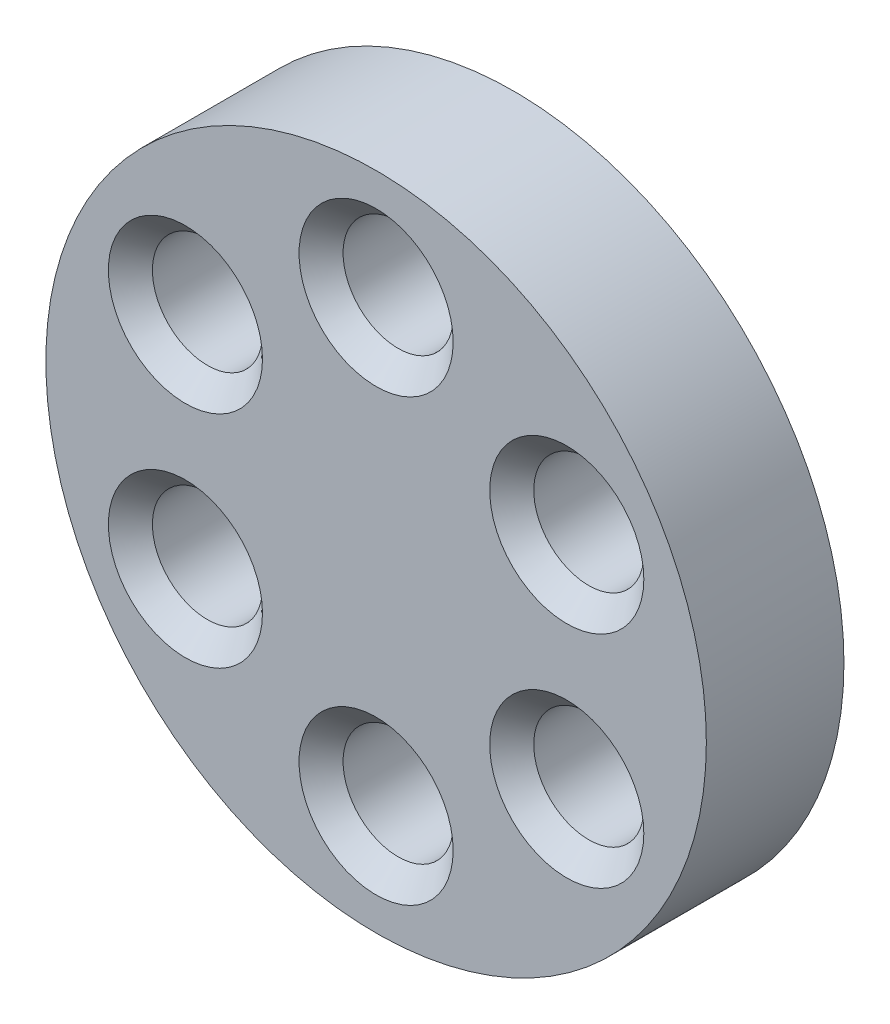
ISO-10303-21;
HEADER;
FILE_DESCRIPTION(('STEP AP214'),'2;1');
FILE_NAME('part.step','',(''),(''),'','','');
FILE_SCHEMA(('AUTOMOTIVE_DESIGN { 1 0 10303 214 1 1 1 1 }'));
ENDSEC;
DATA;
#1=APPLICATION_CONTEXT('core data for automotive mechanical design processes');
#2=APPLICATION_PROTOCOL_DEFINITION('international standard','automotive_design',2000,#1);
#3=PRODUCT_CONTEXT('',#1,'mechanical');
#4=PRODUCT('Part','Part','',(#3));
#5=PRODUCT_RELATED_PRODUCT_CATEGORY('part','',(#4));
#6=PRODUCT_DEFINITION_FORMATION('','',#4);
#7=PRODUCT_DEFINITION_CONTEXT('part definition',#1,'design');
#8=PRODUCT_DEFINITION('design','',#6,#7);
#9=PRODUCT_DEFINITION_SHAPE('','',#8);
#10=(LENGTH_UNIT() NAMED_UNIT(*) SI_UNIT(.MILLI.,.METRE.));
#11=(NAMED_UNIT(*) PLANE_ANGLE_UNIT() SI_UNIT($,.RADIAN.));
#12=(NAMED_UNIT(*) SI_UNIT($,.STERADIAN.) SOLID_ANGLE_UNIT());
#13=UNCERTAINTY_MEASURE_WITH_UNIT(LENGTH_MEASURE(1.E-05),#10,'distance_accuracy_value','');
#14=(GEOMETRIC_REPRESENTATION_CONTEXT(3) GLOBAL_UNCERTAINTY_ASSIGNED_CONTEXT((#13)) GLOBAL_UNIT_ASSIGNED_CONTEXT((#10,
#11,#12)) REPRESENTATION_CONTEXT('',''));
#15=CARTESIAN_POINT('',(0.,0.,0.));
#16=DIRECTION('',(0.,0.,1.));
#17=DIRECTION('',(1.,0.,0.));
#18=AXIS2_PLACEMENT_3D('',#15,#16,#17);
#19=CARTESIAN_POINT('',(0.,0.,25.));
#20=DIRECTION('',(0.,0.,-1.));
#21=DIRECTION('',(-1.,0.,0.));
#22=AXIS2_PLACEMENT_3D('',#19,#20,#21);
#23=CYLINDRICAL_SURFACE('',#22,60.);
#24=CARTESIAN_POINT('',(0.,0.,25.));
#25=DIRECTION('',(0.,0.,1.));
#26=DIRECTION('',(1.,0.,0.));
#27=AXIS2_PLACEMENT_3D('',#24,#25,#26);
#28=CIRCLE('',#27,60.);
#29=CARTESIAN_POINT('',(60.,0.,25.));
#30=VERTEX_POINT('',#29);
#31=EDGE_CURVE('E113',#30,#30,#28,.T.);
#32=ORIENTED_EDGE('',*,*,#31,.F.);
#33=EDGE_LOOP('',(#32));
#34=FACE_BOUND('',#33,.T.);
#35=CARTESIAN_POINT('',(0.,0.,0.));
#36=DIRECTION('',(0.,0.,1.));
#37=DIRECTION('',(1.,0.,0.));
#38=AXIS2_PLACEMENT_3D('',#35,#36,#37);
#39=CIRCLE('',#38,60.);
#40=CARTESIAN_POINT('',(60.,0.,0.));
#41=VERTEX_POINT('',#40);
#42=EDGE_CURVE('E114',#41,#41,#39,.T.);
#43=ORIENTED_EDGE('',*,*,#42,.T.);
#44=EDGE_LOOP('',(#43));
#45=FACE_BOUND('',#44,.T.);
#46=ADVANCED_FACE('F33',(#34,#45),#23,.T.);
#47=CARTESIAN_POINT('',(0.,0.,25.));
#48=DIRECTION('',(0.,0.,1.));
#49=DIRECTION('',(1.,0.,0.));
#50=AXIS2_PLACEMENT_3D('',#47,#48,#49);
#51=PLANE('',#50);
#52=CARTESIAN_POINT('',(-34.6410161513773,20.0000000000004,25.));
#53=DIRECTION('',(0.,0.,1.));
#54=DIRECTION('',(1.,0.,0.));
#55=AXIS2_PLACEMENT_3D('',#52,#53,#54);
#56=CIRCLE('',#55,14.);
#57=CARTESIAN_POINT('',(-20.6410161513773,20.0000000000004,25.));
#58=VERTEX_POINT('',#57);
#59=EDGE_CURVE('E40',#58,#58,#56,.F.);
#60=ORIENTED_EDGE('',*,*,#59,.T.);
#61=EDGE_LOOP('',(#60));
#62=FACE_BOUND('',#61,.T.);
#63=CARTESIAN_POINT('',(-34.6410161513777,-19.9999999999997,25.));
#64=DIRECTION('',(0.,0.,1.));
#65=DIRECTION('',(1.,0.,0.));
#66=AXIS2_PLACEMENT_3D('',#63,#64,#65);
#67=CIRCLE('',#66,14.);
#68=CARTESIAN_POINT('',(-20.6410161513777,-19.9999999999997,25.));
#69=VERTEX_POINT('',#68);
#70=EDGE_CURVE('E56',#69,#69,#67,.F.);
#71=ORIENTED_EDGE('',*,*,#70,.T.);
#72=EDGE_LOOP('',(#71));
#73=FACE_BOUND('',#72,.T.);
#74=CARTESIAN_POINT('',(0.,-40.,25.));
#75=DIRECTION('',(0.,0.,1.));
#76=DIRECTION('',(1.,0.,0.));
#77=AXIS2_PLACEMENT_3D('',#74,#75,#76);
#78=CIRCLE('',#77,14.);
#79=CARTESIAN_POINT('',(14.,-40.,25.));
#80=VERTEX_POINT('',#79);
#81=EDGE_CURVE('E68',#80,#80,#78,.F.);
#82=ORIENTED_EDGE('',*,*,#81,.T.);
#83=EDGE_LOOP('',(#82));
#84=FACE_BOUND('',#83,.T.);
#85=CARTESIAN_POINT('',(34.6410161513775,-20.0000000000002,25.));
#86=DIRECTION('',(0.,0.,1.));
#87=DIRECTION('',(1.,0.,0.));
#88=AXIS2_PLACEMENT_3D('',#85,#86,#87);
#89=CIRCLE('',#88,14.);
#90=CARTESIAN_POINT('',(48.6410161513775,-20.0000000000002,25.));
#91=VERTEX_POINT('',#90);
#92=EDGE_CURVE('E80',#91,#91,#89,.F.);
#93=ORIENTED_EDGE('',*,*,#92,.T.);
#94=EDGE_LOOP('',(#93));
#95=FACE_BOUND('',#94,.T.);
#96=CARTESIAN_POINT('',(34.6410161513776,19.9999999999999,25.));
#97=DIRECTION('',(0.,0.,1.));
#98=DIRECTION('',(1.,0.,0.));
#99=AXIS2_PLACEMENT_3D('',#96,#97,#98);
#100=CIRCLE('',#99,14.);
#101=CARTESIAN_POINT('',(48.6410161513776,19.9999999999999,25.));
#102=VERTEX_POINT('',#101);
#103=EDGE_CURVE('E92',#102,#102,#100,.F.);
#104=ORIENTED_EDGE('',*,*,#103,.T.);
#105=EDGE_LOOP('',(#104));
#106=FACE_BOUND('',#105,.T.);
#107=CARTESIAN_POINT('',(0.,40.,25.));
#108=DIRECTION('',(0.,0.,1.));
#109=DIRECTION('',(1.,0.,0.));
#110=AXIS2_PLACEMENT_3D('',#107,#108,#109);
#111=CIRCLE('',#110,14.);
#112=CARTESIAN_POINT('',(14.,40.,25.));
#113=VERTEX_POINT('',#112);
#114=EDGE_CURVE('E104',#113,#113,#111,.F.);
#115=ORIENTED_EDGE('',*,*,#114,.T.);
#116=EDGE_LOOP('',(#115));
#117=FACE_BOUND('',#116,.T.);
#118=ORIENTED_EDGE('',*,*,#31,.T.);
#119=EDGE_LOOP('',(#118));
#120=FACE_BOUND('',#119,.T.);
#121=ADVANCED_FACE('F120',(#62,#73,#84,#95,#106,#117,#120),#51,.T.);
#122=CARTESIAN_POINT('',(0.,0.,0.));
#123=DIRECTION('',(0.,0.,1.));
#124=DIRECTION('',(1.,0.,0.));
#125=AXIS2_PLACEMENT_3D('',#122,#123,#124);
#126=PLANE('',#125);
#127=CARTESIAN_POINT('',(-34.6410161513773,20.0000000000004,0.));
#128=DIRECTION('',(0.,0.,1.));
#129=DIRECTION('',(1.,0.,0.));
#130=AXIS2_PLACEMENT_3D('',#127,#128,#129);
#131=CIRCLE('',#130,14.);
#132=CARTESIAN_POINT('',(-20.6410161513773,20.0000000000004,0.));
#133=VERTEX_POINT('',#132);
#134=EDGE_CURVE('E10',#133,#133,#131,.T.);
#135=ORIENTED_EDGE('',*,*,#134,.T.);
#136=EDGE_LOOP('',(#135));
#137=FACE_BOUND('',#136,.T.);
#138=CARTESIAN_POINT('',(-34.6410161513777,-19.9999999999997,0.));
#139=DIRECTION('',(0.,0.,1.));
#140=DIRECTION('',(1.,0.,0.));
#141=AXIS2_PLACEMENT_3D('',#138,#139,#140);
#142=CIRCLE('',#141,14.);
#143=CARTESIAN_POINT('',(-20.6410161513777,-19.9999999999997,0.));
#144=VERTEX_POINT('',#143);
#145=EDGE_CURVE('E53',#144,#144,#142,.T.);
#146=ORIENTED_EDGE('',*,*,#145,.T.);
#147=EDGE_LOOP('',(#146));
#148=FACE_BOUND('',#147,.T.);
#149=CARTESIAN_POINT('',(0.,-40.,0.));
#150=DIRECTION('',(0.,0.,1.));
#151=DIRECTION('',(1.,0.,0.));
#152=AXIS2_PLACEMENT_3D('',#149,#150,#151);
#153=CIRCLE('',#152,14.);
#154=CARTESIAN_POINT('',(14.,-40.,0.));
#155=VERTEX_POINT('',#154);
#156=EDGE_CURVE('E65',#155,#155,#153,.T.);
#157=ORIENTED_EDGE('',*,*,#156,.T.);
#158=EDGE_LOOP('',(#157));
#159=FACE_BOUND('',#158,.T.);
#160=CARTESIAN_POINT('',(34.6410161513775,-20.0000000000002,0.));
#161=DIRECTION('',(0.,0.,1.));
#162=DIRECTION('',(1.,0.,0.));
#163=AXIS2_PLACEMENT_3D('',#160,#161,#162);
#164=CIRCLE('',#163,14.);
#165=CARTESIAN_POINT('',(48.6410161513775,-20.0000000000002,0.));
#166=VERTEX_POINT('',#165);
#167=EDGE_CURVE('E77',#166,#166,#164,.T.);
#168=ORIENTED_EDGE('',*,*,#167,.T.);
#169=EDGE_LOOP('',(#168));
#170=FACE_BOUND('',#169,.T.);
#171=CARTESIAN_POINT('',(34.6410161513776,19.9999999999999,0.));
#172=DIRECTION('',(0.,0.,1.));
#173=DIRECTION('',(1.,0.,0.));
#174=AXIS2_PLACEMENT_3D('',#171,#172,#173);
#175=CIRCLE('',#174,14.);
#176=CARTESIAN_POINT('',(48.6410161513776,19.9999999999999,0.));
#177=VERTEX_POINT('',#176);
#178=EDGE_CURVE('E89',#177,#177,#175,.T.);
#179=ORIENTED_EDGE('',*,*,#178,.T.);
#180=EDGE_LOOP('',(#179));
#181=FACE_BOUND('',#180,.T.);
#182=CARTESIAN_POINT('',(0.,40.,0.));
#183=DIRECTION('',(0.,0.,1.));
#184=DIRECTION('',(1.,0.,0.));
#185=AXIS2_PLACEMENT_3D('',#182,#183,#184);
#186=CIRCLE('',#185,14.);
#187=CARTESIAN_POINT('',(14.,40.,0.));
#188=VERTEX_POINT('',#187);
#189=EDGE_CURVE('E101',#188,#188,#186,.T.);
#190=ORIENTED_EDGE('',*,*,#189,.T.);
#191=EDGE_LOOP('',(#190));
#192=FACE_BOUND('',#191,.T.);
#193=ORIENTED_EDGE('',*,*,#42,.F.);
#194=EDGE_LOOP('',(#193));
#195=FACE_BOUND('',#194,.T.);
#196=ADVANCED_FACE('F127',(#137,#148,#159,#170,#181,#192,#195),#126,.F.);
#197=CARTESIAN_POINT('',(0.,40.,0.));
#198=DIRECTION('',(0.,0.,1.));
#199=DIRECTION('',(1.,0.,0.));
#200=AXIS2_PLACEMENT_3D('',#197,#198,#199);
#201=CYLINDRICAL_SURFACE('',#200,10.);
#202=CARTESIAN_POINT('',(0.,40.,21.));
#203=DIRECTION('',(0.,0.,1.));
#204=DIRECTION('',(1.,0.,0.));
#205=AXIS2_PLACEMENT_3D('',#202,#203,#204);
#206=CIRCLE('',#205,10.);
#207=CARTESIAN_POINT('',(10.,40.,21.));
#208=VERTEX_POINT('',#207);
#209=EDGE_CURVE('E107',#208,#208,#206,.T.);
#210=ORIENTED_EDGE('',*,*,#209,.T.);
#211=EDGE_LOOP('',(#210));
#212=FACE_BOUND('',#211,.T.);
#213=CARTESIAN_POINT('',(0.,40.,4.00000000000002));
#214=DIRECTION('',(0.,0.,1.));
#215=DIRECTION('',(1.,0.,0.));
#216=AXIS2_PLACEMENT_3D('',#213,#214,#215);
#217=CIRCLE('',#216,10.);
#218=CARTESIAN_POINT('',(10.,40.,4.00000000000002));
#219=VERTEX_POINT('',#218);
#220=EDGE_CURVE('E110',#219,#219,#217,.F.);
#221=ORIENTED_EDGE('',*,*,#220,.T.);
#222=EDGE_LOOP('',(#221));
#223=FACE_BOUND('',#222,.T.);
#224=ADVANCED_FACE('F129',(#212,#223),#201,.F.);
#225=CARTESIAN_POINT('',(0.,40.,21.));
#226=DIRECTION('',(0.,0.,1.));
#227=DIRECTION('',(1.,0.,0.));
#228=AXIS2_PLACEMENT_3D('',#225,#226,#227);
#229=CONICAL_SURFACE('',#228,10.,0.785398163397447);
#230=ORIENTED_EDGE('',*,*,#114,.F.);
#231=EDGE_LOOP('',(#230));
#232=FACE_BOUND('',#231,.T.);
#233=ORIENTED_EDGE('',*,*,#209,.F.);
#234=EDGE_LOOP('',(#233));
#235=FACE_BOUND('',#234,.T.);
#236=ADVANCED_FACE('F136',(#232,#235),#229,.F.);
#237=CARTESIAN_POINT('',(0.,40.,0.));
#238=DIRECTION('',(0.,0.,-1.));
#239=DIRECTION('',(-1.,0.,0.));
#240=AXIS2_PLACEMENT_3D('',#237,#238,#239);
#241=CONICAL_SURFACE('',#240,14.,0.785398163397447);
#242=ORIENTED_EDGE('',*,*,#220,.F.);
#243=EDGE_LOOP('',(#242));
#244=FACE_BOUND('',#243,.T.);
#245=ORIENTED_EDGE('',*,*,#189,.F.);
#246=EDGE_LOOP('',(#245));
#247=FACE_BOUND('',#246,.T.);
#248=ADVANCED_FACE('F144',(#244,#247),#241,.F.);
#249=CARTESIAN_POINT('',(34.6410161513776,19.9999999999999,0.));
#250=DIRECTION('',(0.,0.,1.));
#251=DIRECTION('',(1.,0.,0.));
#252=AXIS2_PLACEMENT_3D('',#249,#250,#251);
#253=CYLINDRICAL_SURFACE('',#252,10.);
#254=CARTESIAN_POINT('',(34.6410161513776,19.9999999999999,21.));
#255=DIRECTION('',(0.,0.,1.));
#256=DIRECTION('',(1.,0.,0.));
#257=AXIS2_PLACEMENT_3D('',#254,#255,#256);
#258=CIRCLE('',#257,10.);
#259=CARTESIAN_POINT('',(44.6410161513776,19.9999999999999,21.));
#260=VERTEX_POINT('',#259);
#261=EDGE_CURVE('E95',#260,#260,#258,.T.);
#262=ORIENTED_EDGE('',*,*,#261,.T.);
#263=EDGE_LOOP('',(#262));
#264=FACE_BOUND('',#263,.T.);
#265=CARTESIAN_POINT('',(34.6410161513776,19.9999999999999,4.00000000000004));
#266=DIRECTION('',(0.,0.,1.));
#267=DIRECTION('',(1.,0.,0.));
#268=AXIS2_PLACEMENT_3D('',#265,#266,#267);
#269=CIRCLE('',#268,10.);
#270=CARTESIAN_POINT('',(44.6410161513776,19.9999999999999,4.00000000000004));
#271=VERTEX_POINT('',#270);
#272=EDGE_CURVE('E98',#271,#271,#269,.F.);
#273=ORIENTED_EDGE('',*,*,#272,.T.);
#274=EDGE_LOOP('',(#273));
#275=FACE_BOUND('',#274,.T.);
#276=ADVANCED_FACE('F148',(#264,#275),#253,.F.);
#277=CARTESIAN_POINT('',(34.6410161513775,-20.0000000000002,0.));
#278=DIRECTION('',(0.,0.,1.));
#279=DIRECTION('',(1.,0.,0.));
#280=AXIS2_PLACEMENT_3D('',#277,#278,#279);
#281=CYLINDRICAL_SURFACE('',#280,10.);
#282=CARTESIAN_POINT('',(34.6410161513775,-20.0000000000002,21.));
#283=DIRECTION('',(0.,0.,1.));
#284=DIRECTION('',(1.,0.,0.));
#285=AXIS2_PLACEMENT_3D('',#282,#283,#284);
#286=CIRCLE('',#285,10.);
#287=CARTESIAN_POINT('',(44.6410161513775,-20.0000000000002,21.));
#288=VERTEX_POINT('',#287);
#289=EDGE_CURVE('E83',#288,#288,#286,.T.);
#290=ORIENTED_EDGE('',*,*,#289,.T.);
#291=EDGE_LOOP('',(#290));
#292=FACE_BOUND('',#291,.T.);
#293=CARTESIAN_POINT('',(34.6410161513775,-20.0000000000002,4.00000000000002));
#294=DIRECTION('',(0.,0.,1.));
#295=DIRECTION('',(1.,0.,0.));
#296=AXIS2_PLACEMENT_3D('',#293,#294,#295);
#297=CIRCLE('',#296,10.);
#298=CARTESIAN_POINT('',(44.6410161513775,-20.0000000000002,4.00000000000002));
#299=VERTEX_POINT('',#298);
#300=EDGE_CURVE('E86',#299,#299,#297,.F.);
#301=ORIENTED_EDGE('',*,*,#300,.T.);
#302=EDGE_LOOP('',(#301));
#303=FACE_BOUND('',#302,.T.);
#304=ADVANCED_FACE('F207',(#292,#303),#281,.F.);
#305=CARTESIAN_POINT('',(0.,-40.,0.));
#306=DIRECTION('',(0.,0.,1.));
#307=DIRECTION('',(1.,0.,0.));
#308=AXIS2_PLACEMENT_3D('',#305,#306,#307);
#309=CYLINDRICAL_SURFACE('',#308,10.);
#310=CARTESIAN_POINT('',(0.,-40.,21.));
#311=DIRECTION('',(0.,0.,1.));
#312=DIRECTION('',(1.,0.,0.));
#313=AXIS2_PLACEMENT_3D('',#310,#311,#312);
#314=CIRCLE('',#313,10.);
#315=CARTESIAN_POINT('',(10.,-40.,21.));
#316=VERTEX_POINT('',#315);
#317=EDGE_CURVE('E71',#316,#316,#314,.T.);
#318=ORIENTED_EDGE('',*,*,#317,.T.);
#319=EDGE_LOOP('',(#318));
#320=FACE_BOUND('',#319,.T.);
#321=CARTESIAN_POINT('',(0.,-40.,4.00000000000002));
#322=DIRECTION('',(0.,0.,1.));
#323=DIRECTION('',(1.,0.,0.));
#324=AXIS2_PLACEMENT_3D('',#321,#322,#323);
#325=CIRCLE('',#324,10.);
#326=CARTESIAN_POINT('',(10.,-40.,4.00000000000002));
#327=VERTEX_POINT('',#326);
#328=EDGE_CURVE('E74',#327,#327,#325,.F.);
#329=ORIENTED_EDGE('',*,*,#328,.T.);
#330=EDGE_LOOP('',(#329));
#331=FACE_BOUND('',#330,.T.);
#332=ADVANCED_FACE('F201',(#320,#331),#309,.F.);
#333=CARTESIAN_POINT('',(-34.6410161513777,-19.9999999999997,0.));
#334=DIRECTION('',(0.,0.,1.));
#335=DIRECTION('',(1.,0.,0.));
#336=AXIS2_PLACEMENT_3D('',#333,#334,#335);
#337=CYLINDRICAL_SURFACE('',#336,10.);
#338=CARTESIAN_POINT('',(-34.6410161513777,-19.9999999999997,21.));
#339=DIRECTION('',(0.,0.,1.));
#340=DIRECTION('',(1.,0.,0.));
#341=AXIS2_PLACEMENT_3D('',#338,#339,#340);
#342=CIRCLE('',#341,10.);
#343=CARTESIAN_POINT('',(-24.6410161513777,-19.9999999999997,21.));
#344=VERTEX_POINT('',#343);
#345=EDGE_CURVE('E59',#344,#344,#342,.T.);
#346=ORIENTED_EDGE('',*,*,#345,.T.);
#347=EDGE_LOOP('',(#346));
#348=FACE_BOUND('',#347,.T.);
#349=CARTESIAN_POINT('',(-34.6410161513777,-19.9999999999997,4.00000000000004));
#350=DIRECTION('',(0.,0.,1.));
#351=DIRECTION('',(1.,0.,0.));
#352=AXIS2_PLACEMENT_3D('',#349,#350,#351);
#353=CIRCLE('',#352,10.);
#354=CARTESIAN_POINT('',(-24.6410161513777,-19.9999999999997,4.00000000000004));
#355=VERTEX_POINT('',#354);
#356=EDGE_CURVE('E62',#355,#355,#353,.F.);
#357=ORIENTED_EDGE('',*,*,#356,.T.);
#358=EDGE_LOOP('',(#357));
#359=FACE_BOUND('',#358,.T.);
#360=ADVANCED_FACE('F194',(#348,#359),#337,.F.);
#361=CARTESIAN_POINT('',(-34.6410161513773,20.0000000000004,0.));
#362=DIRECTION('',(0.,0.,1.));
#363=DIRECTION('',(1.,0.,0.));
#364=AXIS2_PLACEMENT_3D('',#361,#362,#363);
#365=CYLINDRICAL_SURFACE('',#364,10.);
#366=CARTESIAN_POINT('',(-34.6410161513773,20.0000000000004,21.));
#367=DIRECTION('',(0.,0.,1.));
#368=DIRECTION('',(1.,0.,0.));
#369=AXIS2_PLACEMENT_3D('',#366,#367,#368);
#370=CIRCLE('',#369,10.);
#371=CARTESIAN_POINT('',(-24.6410161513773,20.0000000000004,21.));
#372=VERTEX_POINT('',#371);
#373=EDGE_CURVE('E44',#372,#372,#370,.T.);
#374=ORIENTED_EDGE('',*,*,#373,.T.);
#375=EDGE_LOOP('',(#374));
#376=FACE_BOUND('',#375,.T.);
#377=CARTESIAN_POINT('',(-34.6410161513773,20.0000000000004,4.00000000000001));
#378=DIRECTION('',(0.,0.,1.));
#379=DIRECTION('',(1.,0.,0.));
#380=AXIS2_PLACEMENT_3D('',#377,#378,#379);
#381=CIRCLE('',#380,10.);
#382=CARTESIAN_POINT('',(-24.6410161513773,20.0000000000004,4.00000000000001));
#383=VERTEX_POINT('',#382);
#384=EDGE_CURVE('E48',#383,#383,#381,.F.);
#385=ORIENTED_EDGE('',*,*,#384,.T.);
#386=EDGE_LOOP('',(#385));
#387=FACE_BOUND('',#386,.T.);
#388=ADVANCED_FACE('F154',(#376,#387),#365,.F.);
#389=CARTESIAN_POINT('',(34.6410161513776,19.9999999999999,21.));
#390=DIRECTION('',(0.,0.,1.));
#391=DIRECTION('',(1.,0.,0.));
#392=AXIS2_PLACEMENT_3D('',#389,#390,#391);
#393=CONICAL_SURFACE('',#392,10.,0.785398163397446);
#394=ORIENTED_EDGE('',*,*,#103,.F.);
#395=EDGE_LOOP('',(#394));
#396=FACE_BOUND('',#395,.T.);
#397=ORIENTED_EDGE('',*,*,#261,.F.);
#398=EDGE_LOOP('',(#397));
#399=FACE_BOUND('',#398,.T.);
#400=ADVANCED_FACE('F150',(#396,#399),#393,.F.);
#401=CARTESIAN_POINT('',(34.6410161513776,19.9999999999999,0.));
#402=DIRECTION('',(0.,0.,-1.));
#403=DIRECTION('',(-1.,0.,0.));
#404=AXIS2_PLACEMENT_3D('',#401,#402,#403);
#405=CONICAL_SURFACE('',#404,14.,0.785398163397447);
#406=ORIENTED_EDGE('',*,*,#272,.F.);
#407=EDGE_LOOP('',(#406));
#408=FACE_BOUND('',#407,.T.);
#409=ORIENTED_EDGE('',*,*,#178,.F.);
#410=EDGE_LOOP('',(#409));
#411=FACE_BOUND('',#410,.T.);
#412=ADVANCED_FACE('F153',(#408,#411),#405,.F.);
#413=CARTESIAN_POINT('',(34.6410161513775,-20.0000000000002,21.));
#414=DIRECTION('',(0.,0.,1.));
#415=DIRECTION('',(1.,0.,0.));
#416=AXIS2_PLACEMENT_3D('',#413,#414,#415);
#417=CONICAL_SURFACE('',#416,10.,0.785398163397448);
#418=ORIENTED_EDGE('',*,*,#92,.F.);
#419=EDGE_LOOP('',(#418));
#420=FACE_BOUND('',#419,.T.);
#421=ORIENTED_EDGE('',*,*,#289,.F.);
#422=EDGE_LOOP('',(#421));
#423=FACE_BOUND('',#422,.T.);
#424=ADVANCED_FACE('F158',(#420,#423),#417,.F.);
#425=CARTESIAN_POINT('',(34.6410161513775,-20.0000000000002,0.));
#426=DIRECTION('',(0.,0.,-1.));
#427=DIRECTION('',(-1.,0.,0.));
#428=AXIS2_PLACEMENT_3D('',#425,#426,#427);
#429=CONICAL_SURFACE('',#428,14.,0.785398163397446);
#430=ORIENTED_EDGE('',*,*,#300,.F.);
#431=EDGE_LOOP('',(#430));
#432=FACE_BOUND('',#431,.T.);
#433=ORIENTED_EDGE('',*,*,#167,.F.);
#434=EDGE_LOOP('',(#433));
#435=FACE_BOUND('',#434,.T.);
#436=ADVANCED_FACE('F162',(#432,#435),#429,.F.);
#437=CARTESIAN_POINT('',(0.,-40.,21.));
#438=DIRECTION('',(0.,0.,1.));
#439=DIRECTION('',(1.,0.,0.));
#440=AXIS2_PLACEMENT_3D('',#437,#438,#439);
#441=CONICAL_SURFACE('',#440,10.,0.785398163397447);
#442=ORIENTED_EDGE('',*,*,#81,.F.);
#443=EDGE_LOOP('',(#442));
#444=FACE_BOUND('',#443,.T.);
#445=ORIENTED_EDGE('',*,*,#317,.F.);
#446=EDGE_LOOP('',(#445));
#447=FACE_BOUND('',#446,.T.);
#448=ADVANCED_FACE('F166',(#444,#447),#441,.F.);
#449=CARTESIAN_POINT('',(0.,-40.,0.));
#450=DIRECTION('',(0.,0.,-1.));
#451=DIRECTION('',(-1.,0.,0.));
#452=AXIS2_PLACEMENT_3D('',#449,#450,#451);
#453=CONICAL_SURFACE('',#452,14.,0.785398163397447);
#454=ORIENTED_EDGE('',*,*,#328,.F.);
#455=EDGE_LOOP('',(#454));
#456=FACE_BOUND('',#455,.T.);
#457=ORIENTED_EDGE('',*,*,#156,.F.);
#458=EDGE_LOOP('',(#457));
#459=FACE_BOUND('',#458,.T.);
#460=ADVANCED_FACE('F170',(#456,#459),#453,.F.);
#461=CARTESIAN_POINT('',(-34.6410161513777,-19.9999999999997,21.));
#462=DIRECTION('',(0.,0.,1.));
#463=DIRECTION('',(1.,0.,0.));
#464=AXIS2_PLACEMENT_3D('',#461,#462,#463);
#465=CONICAL_SURFACE('',#464,10.,0.785398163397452);
#466=ORIENTED_EDGE('',*,*,#70,.F.);
#467=EDGE_LOOP('',(#466));
#468=FACE_BOUND('',#467,.T.);
#469=ORIENTED_EDGE('',*,*,#345,.F.);
#470=EDGE_LOOP('',(#469));
#471=FACE_BOUND('',#470,.T.);
#472=ADVANCED_FACE('F174',(#468,#471),#465,.F.);
#473=CARTESIAN_POINT('',(-34.6410161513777,-19.9999999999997,0.));
#474=DIRECTION('',(0.,0.,-1.));
#475=DIRECTION('',(-1.,0.,0.));
#476=AXIS2_PLACEMENT_3D('',#473,#474,#475);
#477=CONICAL_SURFACE('',#476,14.,0.785398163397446);
#478=ORIENTED_EDGE('',*,*,#356,.F.);
#479=EDGE_LOOP('',(#478));
#480=FACE_BOUND('',#479,.T.);
#481=ORIENTED_EDGE('',*,*,#145,.F.);
#482=EDGE_LOOP('',(#481));
#483=FACE_BOUND('',#482,.T.);
#484=ADVANCED_FACE('F178',(#480,#483),#477,.F.);
#485=CARTESIAN_POINT('',(-34.6410161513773,20.0000000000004,21.));
#486=DIRECTION('',(0.,0.,1.));
#487=DIRECTION('',(1.,0.,0.));
#488=AXIS2_PLACEMENT_3D('',#485,#486,#487);
#489=CONICAL_SURFACE('',#488,10.,0.78539816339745);
#490=ORIENTED_EDGE('',*,*,#59,.F.);
#491=EDGE_LOOP('',(#490));
#492=FACE_BOUND('',#491,.T.);
#493=ORIENTED_EDGE('',*,*,#373,.F.);
#494=EDGE_LOOP('',(#493));
#495=FACE_BOUND('',#494,.T.);
#496=ADVANCED_FACE('F181',(#492,#495),#489,.F.);
#497=CARTESIAN_POINT('',(-34.6410161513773,20.0000000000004,0.));
#498=DIRECTION('',(0.,0.,-1.));
#499=DIRECTION('',(-1.,0.,0.));
#500=AXIS2_PLACEMENT_3D('',#497,#498,#499);
#501=CONICAL_SURFACE('',#500,14.,0.785398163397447);
#502=ORIENTED_EDGE('',*,*,#384,.F.);
#503=EDGE_LOOP('',(#502));
#504=FACE_BOUND('',#503,.T.);
#505=ORIENTED_EDGE('',*,*,#134,.F.);
#506=EDGE_LOOP('',(#505));
#507=FACE_BOUND('',#506,.T.);
#508=ADVANCED_FACE('F35',(#504,#507),#501,.F.);
#509=CLOSED_SHELL('',(#46,#121,#196,#224,#236,#248,#276,#304,#332,#360,#388,#400,#412,#424,#436,
#448,#460,#472,#484,#496,#508));
#510=MANIFOLD_SOLID_BREP('B2',#509);
#511=ADVANCED_BREP_SHAPE_REPRESENTATION('',(#18,#510),#14);
#512=SHAPE_DEFINITION_REPRESENTATION(#9,#511);
ENDSEC;
END-ISO-10303-21;
